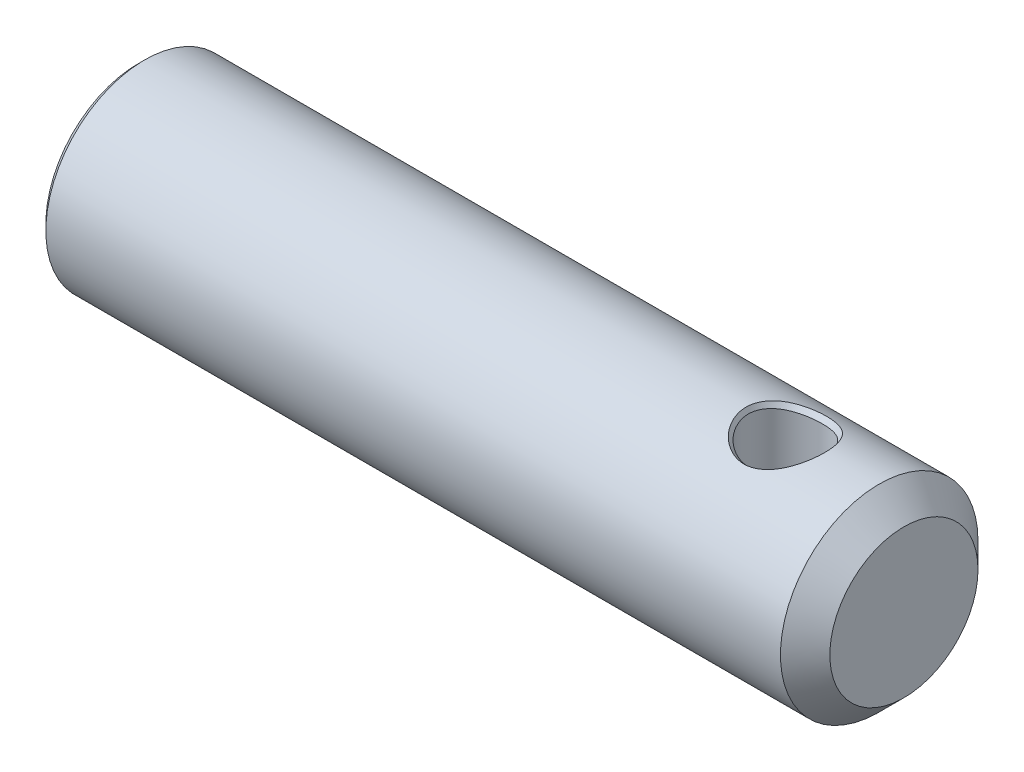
ISO-10303-21;
HEADER;
FILE_DESCRIPTION(('STEP AP214'),'2;1');
FILE_NAME('part.step','',(''),(''),'','','');
FILE_SCHEMA(('AUTOMOTIVE_DESIGN { 1 0 10303 214 1 1 1 1 }'));
ENDSEC;
DATA;
#1=APPLICATION_CONTEXT('core data for automotive mechanical design processes');
#2=APPLICATION_PROTOCOL_DEFINITION('international standard','automotive_design',2000,#1);
#3=PRODUCT_CONTEXT('',#1,'mechanical');
#4=PRODUCT('Part','Part','',(#3));
#5=PRODUCT_RELATED_PRODUCT_CATEGORY('part','',(#4));
#6=PRODUCT_DEFINITION_FORMATION('','',#4);
#7=PRODUCT_DEFINITION_CONTEXT('part definition',#1,'design');
#8=PRODUCT_DEFINITION('design','',#6,#7);
#9=PRODUCT_DEFINITION_SHAPE('','',#8);
#10=(LENGTH_UNIT() NAMED_UNIT(*) SI_UNIT(.MILLI.,.METRE.));
#11=(NAMED_UNIT(*) PLANE_ANGLE_UNIT() SI_UNIT($,.RADIAN.));
#12=(NAMED_UNIT(*) SI_UNIT($,.STERADIAN.) SOLID_ANGLE_UNIT());
#13=UNCERTAINTY_MEASURE_WITH_UNIT(LENGTH_MEASURE(1.E-05),#10,'distance_accuracy_value','');
#14=(GEOMETRIC_REPRESENTATION_CONTEXT(3) GLOBAL_UNCERTAINTY_ASSIGNED_CONTEXT((#13)) GLOBAL_UNIT_ASSIGNED_CONTEXT((#10,
#11,#12)) REPRESENTATION_CONTEXT('',''));
#15=CARTESIAN_POINT('',(0.,0.,0.));
#16=DIRECTION('',(0.,0.,1.));
#17=DIRECTION('',(1.,0.,0.));
#18=AXIS2_PLACEMENT_3D('',#15,#16,#17);
#19=CARTESIAN_POINT('',(31.,0.,0.));
#20=DIRECTION('',(-1.,0.,0.));
#21=DIRECTION('',(0.,0.,1.));
#22=AXIS2_PLACEMENT_3D('',#19,#20,#21);
#23=CYLINDRICAL_SURFACE('',#22,4.);
#24=CARTESIAN_POINT('',(26.2,-3.63262491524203,1.67452567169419));
#25=CARTESIAN_POINT('',(26.1735415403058,-3.63263646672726,1.67449462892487));
#26=CARTESIAN_POINT('',(26.1470862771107,-3.63300387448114,1.67374769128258));
#27=CARTESIAN_POINT('',(26.0943341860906,-3.6344093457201,1.67084974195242));
#28=CARTESIAN_POINT('',(26.0680371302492,-3.63544579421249,1.66870211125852));
#29=CARTESIAN_POINT('',(26.015653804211,-3.63814726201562,1.66303317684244));
#30=CARTESIAN_POINT('',(25.9895673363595,-3.63981159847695,1.65951336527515));
#31=CARTESIAN_POINT('',(25.9376556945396,-3.64372588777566,1.65113222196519));
#32=CARTESIAN_POINT('',(25.9118305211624,-3.64597584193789,1.64627088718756));
#33=CARTESIAN_POINT('',(25.8604922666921,-3.65101896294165,1.63523786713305));
#34=CARTESIAN_POINT('',(25.8349794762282,-3.65381260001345,1.62906504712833));
#35=CARTESIAN_POINT('',(25.7843166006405,-3.6599008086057,1.61544002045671));
#36=CARTESIAN_POINT('',(25.7591671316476,-3.66319614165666,1.60798586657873));
#37=CARTESIAN_POINT('',(25.7092815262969,-3.67024565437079,1.59182878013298));
#38=CARTESIAN_POINT('',(25.6845463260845,-3.6740007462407,1.58312335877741));
#39=CARTESIAN_POINT('',(25.6355398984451,-3.68192781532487,1.56449409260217));
#40=CARTESIAN_POINT('',(25.6112698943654,-3.68610074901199,1.55456743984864));
#41=CARTESIAN_POINT('',(25.5632445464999,-3.69482163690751,1.53352584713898));
#42=CARTESIAN_POINT('',(25.5394906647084,-3.69937051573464,1.52240795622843));
#43=CARTESIAN_POINT('',(25.492548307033,-3.70880150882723,1.49901385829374));
#44=CARTESIAN_POINT('',(25.4693614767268,-3.7136844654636,1.48673469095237));
#45=CARTESIAN_POINT('',(25.4236040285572,-3.7237418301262,1.46104787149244));
#46=CARTESIAN_POINT('',(25.4010351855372,-3.72891696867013,1.44763734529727));
#47=CARTESIAN_POINT('',(25.3565645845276,-3.73951709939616,1.4197175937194));
#48=CARTESIAN_POINT('',(25.3346646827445,-3.74494269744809,1.40520564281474));
#49=CARTESIAN_POINT('',(25.2915828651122,-3.75600155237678,1.37511260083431));
#50=CARTESIAN_POINT('',(25.2704028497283,-3.76163528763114,1.35952896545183));
#51=CARTESIAN_POINT('',(25.2288118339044,-3.77307049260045,1.32732271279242));
#52=CARTESIAN_POINT('',(25.2084027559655,-3.77887232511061,1.31069774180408));
#53=CARTESIAN_POINT('',(25.168404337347,-3.79059528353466,1.27643661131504));
#54=CARTESIAN_POINT('',(25.1488169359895,-3.7965166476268,1.25879826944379));
#55=CARTESIAN_POINT('',(25.1105138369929,-3.80846207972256,1.22254703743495));
#56=CARTESIAN_POINT('',(25.091800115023,-3.81448634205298,1.20393212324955));
#57=CARTESIAN_POINT('',(25.0552871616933,-3.82650315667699,1.16572661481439));
#58=CARTESIAN_POINT('',(25.0374902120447,-3.83249559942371,1.14613380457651));
#59=CARTESIAN_POINT('',(25.0028313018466,-3.84432236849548,1.10599942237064));
#60=CARTESIAN_POINT('',(24.9859718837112,-3.85015624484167,1.08545552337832));
#61=CARTESIAN_POINT('',(24.9532178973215,-3.86165718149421,1.04348271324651));
#62=CARTESIAN_POINT('',(24.9373258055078,-3.86732379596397,1.02205174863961));
#63=CARTESIAN_POINT('',(24.9065353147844,-3.87844939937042,0.978359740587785));
#64=CARTESIAN_POINT('',(24.8916392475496,-3.88390788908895,0.956096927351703));
#65=CARTESIAN_POINT('',(24.8628700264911,-3.89458503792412,0.910798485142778));
#66=CARTESIAN_POINT('',(24.8489990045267,-3.89980318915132,0.887761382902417));
#67=CARTESIAN_POINT('',(24.8223090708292,-3.90996510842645,0.840970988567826));
#68=CARTESIAN_POINT('',(24.8094920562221,-3.914908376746,0.817216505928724));
#69=CARTESIAN_POINT('',(24.7849393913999,-3.92448657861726,0.769048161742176));
#70=CARTESIAN_POINT('',(24.7732053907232,-3.929121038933,0.7446333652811));
#71=CARTESIAN_POINT('',(24.750848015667,-3.93804748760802,0.695201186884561));
#72=CARTESIAN_POINT('',(24.7402260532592,-3.94233903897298,0.670183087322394));
#73=CARTESIAN_POINT('',(24.7201220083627,-3.95054556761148,0.619601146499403));
#74=CARTESIAN_POINT('',(24.7106411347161,-3.95446014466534,0.594036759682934));
#75=CARTESIAN_POINT('',(24.6928484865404,-3.96187861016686,0.542419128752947));
#76=CARTESIAN_POINT('',(24.6845377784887,-3.96538212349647,0.516365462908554));
#77=CARTESIAN_POINT('',(24.6691146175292,-3.97194436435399,0.46382620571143));
#78=CARTESIAN_POINT('',(24.6620031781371,-3.97500271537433,0.437340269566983));
#79=CARTESIAN_POINT('',(24.6490076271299,-3.98064055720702,0.383993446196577));
#80=CARTESIAN_POINT('',(24.643124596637,-3.98321962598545,0.357132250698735));
#81=CARTESIAN_POINT('',(24.6326147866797,-3.98786489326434,0.303091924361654));
#82=CARTESIAN_POINT('',(24.6279893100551,-3.98993055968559,0.275912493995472));
#83=CARTESIAN_POINT('',(24.6200234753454,-3.99351501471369,0.221292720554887));
#84=CARTESIAN_POINT('',(24.6166848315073,-3.99503307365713,0.193852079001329));
#85=CARTESIAN_POINT('',(24.6113209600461,-3.99748864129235,0.138766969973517));
#86=CARTESIAN_POINT('',(24.6092980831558,-3.99842511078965,0.111122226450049));
#87=CARTESIAN_POINT('',(24.6065952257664,-3.99968303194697,0.0556857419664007));
#88=CARTESIAN_POINT('',(24.6059184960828,-4.00000299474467,0.027893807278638));
#89=CARTESIAN_POINT('',(24.6059318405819,-3.99999700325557,-0.0276839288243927));
#90=CARTESIAN_POINT('',(24.6066216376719,-3.99967117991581,-0.0554697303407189));
#91=CARTESIAN_POINT('',(24.6093431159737,-3.99840624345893,-0.110883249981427));
#92=CARTESIAN_POINT('',(24.6113710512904,-3.99746884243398,-0.138511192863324));
#93=CARTESIAN_POINT('',(24.6167399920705,-3.99501427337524,-0.193553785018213));
#94=CARTESIAN_POINT('',(24.6200782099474,-3.99349833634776,-0.220968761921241));
#95=CARTESIAN_POINT('',(24.6280377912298,-3.98992096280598,-0.275530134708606));
#96=CARTESIAN_POINT('',(24.6326570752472,-3.98786041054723,-0.302676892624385));
#97=CARTESIAN_POINT('',(24.6431494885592,-3.9832277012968,-0.356646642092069));
#98=CARTESIAN_POINT('',(24.6490210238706,-3.98065619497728,-0.383469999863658));
#99=CARTESIAN_POINT('',(24.6619887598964,-3.97503542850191,-0.436737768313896));
#100=CARTESIAN_POINT('',(24.6690836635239,-3.97198667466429,-0.463182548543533));
#101=CARTESIAN_POINT('',(24.6844691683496,-3.96544516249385,-0.51563797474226));
#102=CARTESIAN_POINT('',(24.6927586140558,-3.96195283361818,-0.541649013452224));
#103=CARTESIAN_POINT('',(24.7105043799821,-3.95455786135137,-0.593181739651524));
#104=CARTESIAN_POINT('',(24.719959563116,-3.95065561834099,-0.618703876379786));
#105=CARTESIAN_POINT('',(24.7400081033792,-3.94247446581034,-0.669203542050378));
#106=CARTESIAN_POINT('',(24.7506002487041,-3.93819595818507,-0.694181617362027));
#107=CARTESIAN_POINT('',(24.7728941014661,-3.92929588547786,-0.743537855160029));
#108=CARTESIAN_POINT('',(24.784594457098,-3.92467473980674,-0.767916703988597));
#109=CARTESIAN_POINT('',(24.8090761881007,-3.91512303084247,-0.816019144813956));
#110=CARTESIAN_POINT('',(24.8218560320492,-3.91019290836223,-0.839743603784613));
#111=CARTESIAN_POINT('',(24.8484682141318,-3.90005671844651,-0.886481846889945));
#112=CARTESIAN_POINT('',(24.8622988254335,-3.89485110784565,-0.909496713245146));
#113=CARTESIAN_POINT('',(24.8909841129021,-3.88419803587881,-0.954760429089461));
#114=CARTESIAN_POINT('',(24.9058368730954,-3.87875103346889,-0.977010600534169));
#115=CARTESIAN_POINT('',(24.9365377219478,-3.86764699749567,-1.02068913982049));
#116=CARTESIAN_POINT('',(24.9523837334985,-3.86199041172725,-1.04211908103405));
#117=CARTESIAN_POINT('',(24.9850434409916,-3.85050755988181,-1.08410292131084));
#118=CARTESIAN_POINT('',(25.0018549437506,-3.84468169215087,-1.10465863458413));
#119=CARTESIAN_POINT('',(25.0364137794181,-3.83286897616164,-1.14483398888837));
#120=CARTESIAN_POINT('',(25.0541588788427,-3.82688252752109,-1.16445566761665));
#121=CARTESIAN_POINT('',(25.0905739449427,-3.8148733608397,-1.20273027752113));
#122=CARTESIAN_POINT('',(25.1092419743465,-3.80885074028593,-1.2213850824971));
#123=CARTESIAN_POINT('',(25.1474685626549,-3.7969030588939,-1.2577185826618));
#124=CARTESIAN_POINT('',(25.1670254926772,-3.79097784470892,-1.27539894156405));
#125=CARTESIAN_POINT('',(25.2069747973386,-3.77924289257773,-1.30974777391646));
#126=CARTESIAN_POINT('',(25.227365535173,-3.77343295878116,-1.32641808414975));
#127=CARTESIAN_POINT('',(25.2689315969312,-3.76197797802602,-1.35871679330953));
#128=CARTESIAN_POINT('',(25.2901052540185,-3.75633262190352,-1.37434722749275));
#129=CARTESIAN_POINT('',(25.3331851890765,-3.74524780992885,-1.40453456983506));
#130=CARTESIAN_POINT('',(25.3550897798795,-3.73980793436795,-1.41909373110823));
#131=CARTESIAN_POINT('',(25.3995799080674,-3.72917735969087,-1.44710731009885));
#132=CARTESIAN_POINT('',(25.4221637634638,-3.72398611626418,-1.46056419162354));
#133=CARTESIAN_POINT('',(25.467960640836,-3.71389549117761,-1.48634188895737));
#134=CARTESIAN_POINT('',(25.4911720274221,-3.70899544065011,-1.49866534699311));
#135=CARTESIAN_POINT('',(25.5381721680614,-3.69953004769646,-1.52214493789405));
#136=CARTESIAN_POINT('',(25.5619593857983,-3.69496392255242,-1.53330382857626));
#137=CARTESIAN_POINT('',(25.6100593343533,-3.68620917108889,-1.55442308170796));
#138=CARTESIAN_POINT('',(25.6343706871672,-3.6820196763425,-1.56438622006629));
#139=CARTESIAN_POINT('',(25.6834669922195,-3.67406095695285,-1.58308286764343));
#140=CARTESIAN_POINT('',(25.7082507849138,-3.6702908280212,-1.59181903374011));
#141=CARTESIAN_POINT('',(25.7582400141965,-3.66321355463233,-1.60803077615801));
#142=CARTESIAN_POINT('',(25.7834445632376,-3.65990554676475,-1.61550870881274));
#143=CARTESIAN_POINT('',(25.8342232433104,-3.65379514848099,-1.62917320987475));
#144=CARTESIAN_POINT('',(25.8597967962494,-3.65099204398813,-1.63536160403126));
#145=CARTESIAN_POINT('',(25.9112616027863,-3.64593397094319,-1.64641649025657));
#146=CARTESIAN_POINT('',(25.9371525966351,-3.64367858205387,-1.65128399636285));
#147=CARTESIAN_POINT('',(25.9891996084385,-3.63975830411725,-1.65966685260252));
#148=CARTESIAN_POINT('',(26.0153556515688,-3.63809347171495,-1.66318207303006));
#149=CARTESIAN_POINT('',(26.0678830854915,-3.63539648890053,-1.66883045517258));
#150=CARTESIAN_POINT('',(26.0942546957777,-3.63436509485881,-1.670961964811));
#151=CARTESIAN_POINT('',(26.133902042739,-3.63332463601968,-1.67309910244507));
#152=CARTESIAN_POINT('',(26.1471448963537,-3.63306224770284,-1.673634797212));
#153=CARTESIAN_POINT('',(26.1736647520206,-3.63271151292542,-1.67434934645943));
#154=CARTESIAN_POINT('',(26.186941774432,-3.63262345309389,-1.67452761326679));
#155=CARTESIAN_POINT('',(26.2134954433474,-3.63262639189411,-1.67452369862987));
#156=CARTESIAN_POINT('',(26.2267720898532,-3.6327173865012,-1.67434152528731));
#157=CARTESIAN_POINT('',(26.2532904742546,-3.63307343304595,-1.67361962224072));
#158=CARTESIAN_POINT('',(26.2665322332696,-3.63333819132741,-1.67308049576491));
#159=CARTESIAN_POINT('',(26.3061743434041,-3.63438513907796,-1.6709336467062));
#160=CARTESIAN_POINT('',(26.3325416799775,-3.63542004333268,-1.66879642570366));
#161=CARTESIAN_POINT('',(26.3850579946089,-3.63812254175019,-1.66313810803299));
#162=CARTESIAN_POINT('',(26.4112072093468,-3.63978932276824,-1.65961878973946));
#163=CARTESIAN_POINT('',(26.4632381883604,-3.6437121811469,-1.65122925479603));
#164=CARTESIAN_POINT('',(26.4891200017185,-3.64596814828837,-1.64635929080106));
#165=CARTESIAN_POINT('',(26.5405642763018,-3.65102620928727,-1.6353010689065));
#166=CARTESIAN_POINT('',(26.5661265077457,-3.65382867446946,-1.62911191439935));
#167=CARTESIAN_POINT('',(26.6168805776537,-3.65993678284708,-1.61544752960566));
#168=CARTESIAN_POINT('',(26.6420718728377,-3.66324309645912,-1.60797058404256));
#169=CARTESIAN_POINT('',(26.6920328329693,-3.67031612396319,-1.59176251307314));
#170=CARTESIAN_POINT('',(26.7168016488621,-3.6740836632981,-1.5830291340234));
#171=CARTESIAN_POINT('',(26.7658664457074,-3.68203650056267,-1.56433981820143));
#172=CARTESIAN_POINT('',(26.790161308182,-3.68622267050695,-1.55438131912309));
#173=CARTESIAN_POINT('',(26.8382269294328,-3.69497022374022,-1.53327316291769));
#174=CARTESIAN_POINT('',(26.8619963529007,-3.69953244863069,-1.52212081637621));
#175=CARTESIAN_POINT('',(26.9089597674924,-3.70898964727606,-1.49865619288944));
#176=CARTESIAN_POINT('',(26.9321522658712,-3.71388538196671,-1.48634123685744));
#177=CARTESIAN_POINT('',(26.9779104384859,-3.72396713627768,-1.46058248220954));
#178=CARTESIAN_POINT('',(27.0004745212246,-3.72915380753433,-1.44713611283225));
#179=CARTESIAN_POINT('',(27.0449243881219,-3.73977515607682,-1.41914555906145));
#180=CARTESIAN_POINT('',(27.0668085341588,-3.74521036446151,-1.40459897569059));
#181=CARTESIAN_POINT('',(27.1098470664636,-3.75628591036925,-1.37443883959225));
#182=CARTESIAN_POINT('',(27.1309998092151,-3.7619266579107,-1.35882309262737));
#183=CARTESIAN_POINT('',(27.1725237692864,-3.77337266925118,-1.32655590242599));
#184=CARTESIAN_POINT('',(27.1928933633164,-3.77917823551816,-1.30990247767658));
#185=CARTESIAN_POINT('',(27.2328002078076,-3.79090477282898,-1.27558948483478));
#186=CARTESIAN_POINT('',(27.2523358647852,-3.79682593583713,-1.25792812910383));
#187=CARTESIAN_POINT('',(27.2905203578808,-3.80876630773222,-1.2216352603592));
#188=CARTESIAN_POINT('',(27.3091676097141,-3.81478566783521,-1.20300212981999));
#189=CARTESIAN_POINT('',(27.3455477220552,-3.82679056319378,-1.16476381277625));
#190=CARTESIAN_POINT('',(27.3632782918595,-3.83277598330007,-1.14515641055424));
#191=CARTESIAN_POINT('',(27.3978200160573,-3.84458990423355,-1.10499479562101));
#192=CARTESIAN_POINT('',(27.4146282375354,-3.85041787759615,-1.0844379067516));
#193=CARTESIAN_POINT('',(27.4472917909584,-3.86190789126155,-1.04243907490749));
#194=CARTESIAN_POINT('',(27.4631443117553,-3.8675694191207,-1.0209948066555));
#195=CARTESIAN_POINT('',(27.493866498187,-3.87868555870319,-0.977276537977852));
#196=CARTESIAN_POINT('',(27.5087335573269,-3.88413960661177,-0.955000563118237));
#197=CARTESIAN_POINT('',(27.5374538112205,-3.8948083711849,-0.909675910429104));
#198=CARTESIAN_POINT('',(27.5513046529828,-3.90002252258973,-0.886625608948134));
#199=CARTESIAN_POINT('',(27.5779616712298,-3.91017673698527,-0.839808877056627));
#200=CARTESIAN_POINT('',(27.5907657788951,-3.91511625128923,-0.816041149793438));
#201=CARTESIAN_POINT('',(27.6152984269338,-3.92468703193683,-0.767846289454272));
#202=CARTESIAN_POINT('',(27.6270251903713,-3.92931778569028,-0.743418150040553));
#203=CARTESIAN_POINT('',(27.6493722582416,-3.93823669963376,-0.693959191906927));
#204=CARTESIAN_POINT('',(27.6599910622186,-3.94252439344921,-0.668927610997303));
#205=CARTESIAN_POINT('',(27.6800913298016,-3.95072287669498,-0.618318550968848));
#206=CARTESIAN_POINT('',(27.6895715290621,-3.95463324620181,-0.592740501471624));
#207=CARTESIAN_POINT('',(27.7073637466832,-3.96204275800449,-0.541095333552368));
#208=CARTESIAN_POINT('',(27.7156746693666,-3.96554151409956,-0.515027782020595));
#209=CARTESIAN_POINT('',(27.7310975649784,-3.97209349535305,-0.462460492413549));
#210=CARTESIAN_POINT('',(27.7382085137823,-3.97514633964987,-0.435960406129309));
#211=CARTESIAN_POINT('',(27.7512007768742,-3.98077221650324,-0.382584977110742));
#212=CARTESIAN_POINT('',(27.7570810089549,-3.98334482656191,-0.35570932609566));
#213=CARTESIAN_POINT('',(27.7675813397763,-3.9879760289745,-0.301639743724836));
#214=CARTESIAN_POINT('',(27.7722001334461,-3.9900340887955,-0.274445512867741));
#215=CARTESIAN_POINT('',(27.7801470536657,-3.99360196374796,-0.219795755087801));
#216=CARTESIAN_POINT('',(27.7834734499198,-3.99511104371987,-0.192339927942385));
#217=CARTESIAN_POINT('',(27.7888060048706,-3.9975471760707,-0.137224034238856));
#218=CARTESIAN_POINT('',(27.7908097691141,-3.99847317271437,-0.109563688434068));
#219=CARTESIAN_POINT('',(27.7934648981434,-3.99970817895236,-0.0540955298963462));
#220=CARTESIAN_POINT('',(27.7941129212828,-4.00001566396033,-0.0262875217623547));
#221=CARTESIAN_POINT('',(27.794035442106,-3.99998376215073,0.0293205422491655));
#222=CARTESIAN_POINT('',(27.7933102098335,-3.99964450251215,0.0571205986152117));
#223=CARTESIAN_POINT('',(27.7905161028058,-3.99835298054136,0.112558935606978));
#224=CARTESIAN_POINT('',(27.7884510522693,-3.99740246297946,0.140197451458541));
#225=CARTESIAN_POINT('',(27.7830058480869,-3.99492178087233,0.195257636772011));
#226=CARTESIAN_POINT('',(27.7796285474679,-3.99339287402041,0.222679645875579));
#227=CARTESIAN_POINT('',(27.7715899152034,-3.98978989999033,0.277251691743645));
#228=CARTESIAN_POINT('',(27.7669307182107,-3.98771673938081,0.304402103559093));
#229=CARTESIAN_POINT('',(27.7563583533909,-3.98305926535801,0.358375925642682));
#230=CARTESIAN_POINT('',(27.7504468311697,-3.98047562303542,0.385199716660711));
#231=CARTESIAN_POINT('',(27.7373998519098,-3.97483117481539,0.438465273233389));
#232=CARTESIAN_POINT('',(27.7302657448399,-3.97177089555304,0.464907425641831));
#233=CARTESIAN_POINT('',(27.7148033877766,-3.96520705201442,0.517354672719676));
#234=CARTESIAN_POINT('',(27.7064763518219,-3.96170393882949,0.543360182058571));
#235=CARTESIAN_POINT('',(27.6886577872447,-3.95428824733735,0.594879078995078));
#236=CARTESIAN_POINT('',(27.6791674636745,-3.950376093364,0.620392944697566));
#237=CARTESIAN_POINT('',(27.6590518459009,-3.94217609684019,0.670873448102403));
#238=CARTESIAN_POINT('',(27.6484278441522,-3.93788868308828,0.695840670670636));
#239=CARTESIAN_POINT('',(27.6260743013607,-3.92897190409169,0.745172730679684));
#240=CARTESIAN_POINT('',(27.6143462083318,-3.92434298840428,0.769538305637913));
#241=CARTESIAN_POINT('',(27.5898138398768,-3.91477697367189,0.817611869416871));
#242=CARTESIAN_POINT('',(27.5770112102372,-3.90984034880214,0.841320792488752));
#243=CARTESIAN_POINT('',(27.5503591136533,-3.89969251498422,0.888025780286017));
#244=CARTESIAN_POINT('',(27.536511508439,-3.89448179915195,0.911023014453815));
#245=CARTESIAN_POINT('',(27.5077986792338,-3.88382001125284,0.956249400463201));
#246=CARTESIAN_POINT('',(27.4929355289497,-3.87836943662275,0.978479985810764));
#247=CARTESIAN_POINT('',(27.4622212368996,-3.86725986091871,1.02211748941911));
#248=CARTESIAN_POINT('',(27.4463723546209,-3.86160134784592,1.04352612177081));
#249=CARTESIAN_POINT('',(27.413714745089,-3.85011644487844,1.08546534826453));
#250=CARTESIAN_POINT('',(27.3969084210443,-3.84429049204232,1.10599793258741));
#251=CARTESIAN_POINT('',(27.3623697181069,-3.83247929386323,1.14612612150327));
#252=CARTESIAN_POINT('',(27.3446398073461,-3.82649449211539,1.16572397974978));
#253=CARTESIAN_POINT('',(27.3082580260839,-3.81449017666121,1.20395019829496));
#254=CARTESIAN_POINT('',(27.2896081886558,-3.80847076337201,1.22258052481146));
#255=CARTESIAN_POINT('',(27.2514146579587,-3.79653075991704,1.25886441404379));
#256=CARTESIAN_POINT('',(27.2318725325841,-3.79061001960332,1.27651957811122));
#257=CARTESIAN_POINT('',(27.1919514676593,-3.77888493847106,1.31081831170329));
#258=CARTESIAN_POINT('',(27.1715741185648,-3.77308040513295,1.32746366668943));
#259=CARTESIAN_POINT('',(27.1300340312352,-3.76163711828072,1.35971243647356));
#260=CARTESIAN_POINT('',(27.1088729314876,-3.75599805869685,1.37531785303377));
#261=CARTESIAN_POINT('',(27.0658182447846,-3.74492662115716,1.40545514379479));
#262=CARTESIAN_POINT('',(27.0439263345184,-3.73949382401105,1.41998925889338));
#263=CARTESIAN_POINT('',(26.999462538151,-3.72887810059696,1.44795264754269));
#264=CARTESIAN_POINT('',(26.9768923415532,-3.72369462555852,1.46138439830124));
#265=CARTESIAN_POINT('',(26.9311246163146,-3.71362014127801,1.4871116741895));
#266=CARTESIAN_POINT('',(26.9079287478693,-3.70872845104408,1.49940988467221));
#267=CARTESIAN_POINT('',(26.8609623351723,-3.69928029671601,1.52283874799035));
#268=CARTESIAN_POINT('',(26.8371933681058,-3.69472302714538,1.53397223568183));
#269=CARTESIAN_POINT('',(26.7891334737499,-3.68598642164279,1.55504037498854));
#270=CARTESIAN_POINT('',(26.7648439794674,-3.68180618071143,1.56497791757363));
#271=CARTESIAN_POINT('',(26.7157958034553,-3.67386632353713,1.58362298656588));
#272=CARTESIAN_POINT('',(26.6910383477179,-3.67010574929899,1.59233332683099));
#273=CARTESIAN_POINT('',(26.6411070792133,-3.6630478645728,1.60849294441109));
#274=CARTESIAN_POINT('',(26.6159342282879,-3.65974961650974,1.61594478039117));
#275=CARTESIAN_POINT('',(26.5652250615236,-3.65365893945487,1.62955653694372));
#276=CARTESIAN_POINT('',(26.5396894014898,-3.65086569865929,1.635718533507));
#277=CARTESIAN_POINT('',(26.4883075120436,-3.6458275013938,1.64671994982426));
#278=CARTESIAN_POINT('',(26.4624616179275,-3.64358200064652,1.6515606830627));
#279=CARTESIAN_POINT('',(26.4105122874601,-3.6396815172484,1.6598893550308));
#280=CARTESIAN_POINT('',(26.3844088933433,-3.63802643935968,1.66337751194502));
#281=CARTESIAN_POINT('',(26.3319970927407,-3.63534915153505,1.66897056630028));
#282=CARTESIAN_POINT('',(26.3056885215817,-3.63432751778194,1.67107420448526));
#283=CARTESIAN_POINT('',(26.2529205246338,-3.63295809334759,1.67387033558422));
#284=CARTESIAN_POINT('',(26.2264608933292,-3.63261180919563,1.67455967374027));
#285=CARTESIAN_POINT('',(26.2,-3.63262491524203,1.67452567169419));
#286=B_SPLINE_CURVE_WITH_KNOTS('',3,(#24,#25,#26,#27,#28,#29,#30,#31,#32,#33,#34,#35,#36,#37,
#38,#39,#40,#41,#42,#43,#44,#45,#46,#47,#48,#49,#50,#51,#52,#53,#54,#55,#56,#57,#58,#59,#60,#61,
#62,#63,#64,#65,#66,#67,#68,#69,#70,#71,#72,#73,#74,#75,#76,#77,#78,#79,#80,#81,#82,#83,#84,#85,
#86,#87,#88,#89,#90,#91,#92,#93,#94,#95,#96,#97,#98,#99,#100,#101,#102,#103,#104,#105,#106,#107,
#108,#109,#110,#111,#112,#113,#114,#115,#116,#117,#118,#119,#120,#121,#122,#123,#124,#125,#126,
#127,#128,#129,#130,#131,#132,#133,#134,#135,#136,#137,#138,#139,#140,#141,#142,#143,#144,#145,
#146,#147,#148,#149,#150,#151,#152,#153,#154,#155,#156,#157,#158,#159,#160,#161,#162,#163,#164,
#165,#166,#167,#168,#169,#170,#171,#172,#173,#174,#175,#176,#177,#178,#179,#180,#181,#182,#183,
#184,#185,#186,#187,#188,#189,#190,#191,#192,#193,#194,#195,#196,#197,#198,#199,#200,#201,#202,
#203,#204,#205,#206,#207,#208,#209,#210,#211,#212,#213,#214,#215,#216,#217,#218,#219,#220,#221,
#222,#223,#224,#225,#226,#227,#228,#229,#230,#231,#232,#233,#234,#235,#236,#237,#238,#239,#240,
#241,#242,#243,#244,#245,#246,#247,#248,#249,#250,#251,#252,#253,#254,#255,#256,#257,#258,#259,
#260,#261,#262,#263,#264,#265,#266,#267,#268,#269,#270,#271,#272,#273,#274,#275,#276,#277,#278,
#279,#280,#281,#282,#283,#284,#285),.UNSPECIFIED.,.F.,.F.,(4,2,2,2,2,2,2,2,2,2,2,2,2,2,2,2,2,2,
2,2,2,2,2,2,2,2,2,2,2,2,2,2,2,2,2,2,2,2,2,2,2,2,2,2,2,2,2,2,2,2,2,2,2,2,2,2,2,2,2,2,2,2,2,2,2,2,
2,2,2,2,2,2,2,2,2,2,2,2,2,2,2,2,2,2,2,2,2,2,2,2,2,2,2,2,2,2,2,2,2,2,2,2,2,2,2,2,2,2,2,2,2,2,2,2,
2,2,2,2,2,2,2,2,2,2,2,2,2,2,2,2,4),(0.,0.0793602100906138,0.158529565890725,0.237613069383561,
0.31669675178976,0.39584913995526,0.475122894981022,0.554556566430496,0.634176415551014,
0.713998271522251,0.794029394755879,0.874270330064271,0.95471673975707,1.03536121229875,
1.11619504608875,1.19721001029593,1.27840008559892,1.35978333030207,1.44137746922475,
1.52317239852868,1.60515254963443,1.68729866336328,1.76958953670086,1.8520037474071,
1.93452136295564,2.01712564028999,2.09980472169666,2.18255332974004,2.26537446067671,
2.34828107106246,2.43129774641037,2.51446233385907,2.5978275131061,2.68117578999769,
2.7642917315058,2.84723179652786,2.93003801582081,3.0127394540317,3.09535374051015,
3.17788864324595,3.26034366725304,3.34271166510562,3.42498045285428,3.50713442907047,
3.58915619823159,3.67102820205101,3.75273436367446,3.83426174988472,3.9156022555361,
3.99677872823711,4.07781201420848,4.15869322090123,4.23941116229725,4.31995417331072,
4.40031194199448,4.48047736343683,4.56044841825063,4.64023007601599,4.7198362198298,
4.7992915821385,4.87863367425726,4.95791468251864,5.03720329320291,5.11658639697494,
5.15635032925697,5.19617958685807,5.23600794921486,5.27576917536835,5.35514141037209,
5.4344118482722,5.51366746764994,5.59297712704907,5.67239325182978,5.7519536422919,
5.83168335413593,5.91159661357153,5.99169874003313,6.07198805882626,6.15245779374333,
6.23309793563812,6.3138970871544,6.39484428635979,6.47593081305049,6.55721103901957,
6.63873630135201,6.72049071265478,6.80245337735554,6.88460019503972,6.96690563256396,
7.04934447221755,7.1318935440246,7.2145334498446,7.29725028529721,7.38003736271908,
7.46289693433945,7.54584190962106,7.62889755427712,7.71210315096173,7.79551359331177,
7.87890763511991,7.96206468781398,8.04504194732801,8.12788185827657,8.2106135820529,
8.29325453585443,8.37581197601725,8.45828460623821,8.54066419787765,8.62293721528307,
8.70508644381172,8.78709262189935,8.86893608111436,8.95059839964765,9.03206407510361,
9.1133222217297,9.19440819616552,9.27535679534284,9.35615782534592,9.43679854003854,
9.51726548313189,9.59754634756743,9.67763185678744,9.75751767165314,9.8372063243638,
9.91670917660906,9.99604839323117,10.0752589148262,10.1543904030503,10.233509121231,
10.3126997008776,10.3920667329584),.UNSPECIFIED.);
#287=CARTESIAN_POINT('',(26.2,-3.63262491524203,1.67452567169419));
#288=VERTEX_POINT('',#287);
#289=EDGE_CURVE('E54',#288,#288,#286,.F.);
#290=ORIENTED_EDGE('',*,*,#289,.T.);
#291=EDGE_LOOP('',(#290));
#292=FACE_BOUND('',#291,.T.);
#293=CARTESIAN_POINT('',(26.2,3.63262491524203,1.67452567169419));
#294=CARTESIAN_POINT('',(26.2264584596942,3.63263646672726,1.67449462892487));
#295=CARTESIAN_POINT('',(26.2529137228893,3.63300387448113,1.67374769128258));
#296=CARTESIAN_POINT('',(26.3056658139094,3.6344093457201,1.67084974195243));
#297=CARTESIAN_POINT('',(26.3319628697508,3.63544579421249,1.66870211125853));
#298=CARTESIAN_POINT('',(26.384346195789,3.63814726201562,1.66303317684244));
#299=CARTESIAN_POINT('',(26.4104326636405,3.63981159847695,1.65951336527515));
#300=CARTESIAN_POINT('',(26.4623443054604,3.64372588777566,1.65113222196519));
#301=CARTESIAN_POINT('',(26.4881694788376,3.64597584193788,1.64627088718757));
#302=CARTESIAN_POINT('',(26.5395077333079,3.65101896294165,1.63523786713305));
#303=CARTESIAN_POINT('',(26.5650205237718,3.65381260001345,1.62906504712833));
#304=CARTESIAN_POINT('',(26.6156833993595,3.6599008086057,1.61544002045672));
#305=CARTESIAN_POINT('',(26.6408328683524,3.66319614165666,1.60798586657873));
#306=CARTESIAN_POINT('',(26.6907184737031,3.67024565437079,1.59182878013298));
#307=CARTESIAN_POINT('',(26.7154536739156,3.67400074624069,1.58312335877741));
#308=CARTESIAN_POINT('',(26.7644601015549,3.68192781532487,1.56449409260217));
#309=CARTESIAN_POINT('',(26.7887301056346,3.68610074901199,1.55456743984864));
#310=CARTESIAN_POINT('',(26.8367554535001,3.69482163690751,1.53352584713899));
#311=CARTESIAN_POINT('',(26.8605093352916,3.69937051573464,1.52240795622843));
#312=CARTESIAN_POINT('',(26.907451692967,3.70880150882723,1.49901385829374));
#313=CARTESIAN_POINT('',(26.9306385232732,3.7136844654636,1.48673469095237));
#314=CARTESIAN_POINT('',(26.9763959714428,3.7237418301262,1.46104787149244));
#315=CARTESIAN_POINT('',(26.9989648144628,3.72891696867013,1.44763734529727));
#316=CARTESIAN_POINT('',(27.0434354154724,3.73951709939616,1.4197175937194));
#317=CARTESIAN_POINT('',(27.0653353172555,3.74494269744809,1.40520564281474));
#318=CARTESIAN_POINT('',(27.1084171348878,3.75600155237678,1.37511260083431));
#319=CARTESIAN_POINT('',(27.1295971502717,3.76163528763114,1.35952896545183));
#320=CARTESIAN_POINT('',(27.1711881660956,3.77307049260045,1.32732271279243));
#321=CARTESIAN_POINT('',(27.1915972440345,3.77887232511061,1.31069774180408));
#322=CARTESIAN_POINT('',(27.231595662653,3.79059528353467,1.27643661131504));
#323=CARTESIAN_POINT('',(27.2511830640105,3.7965166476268,1.25879826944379));
#324=CARTESIAN_POINT('',(27.2894861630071,3.80846207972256,1.22254703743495));
#325=CARTESIAN_POINT('',(27.308199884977,3.81448634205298,1.20393212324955));
#326=CARTESIAN_POINT('',(27.3447128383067,3.82650315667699,1.16572661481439));
#327=CARTESIAN_POINT('',(27.3625097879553,3.83249559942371,1.14613380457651));
#328=CARTESIAN_POINT('',(27.3971686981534,3.84432236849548,1.10599942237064));
#329=CARTESIAN_POINT('',(27.4140281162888,3.85015624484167,1.08545552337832));
#330=CARTESIAN_POINT('',(27.4467821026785,3.86165718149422,1.04348271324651));
#331=CARTESIAN_POINT('',(27.4626741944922,3.86732379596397,1.02205174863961));
#332=CARTESIAN_POINT('',(27.4934646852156,3.87844939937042,0.978359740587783));
#333=CARTESIAN_POINT('',(27.5083607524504,3.88390788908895,0.956096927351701));
#334=CARTESIAN_POINT('',(27.5371299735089,3.89458503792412,0.910798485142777));
#335=CARTESIAN_POINT('',(27.5510009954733,3.89980318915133,0.887761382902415));
#336=CARTESIAN_POINT('',(27.5776909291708,3.90996510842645,0.840970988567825));
#337=CARTESIAN_POINT('',(27.5905079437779,3.91490837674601,0.817216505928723));
#338=CARTESIAN_POINT('',(27.6150606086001,3.92448657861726,0.769048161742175));
#339=CARTESIAN_POINT('',(27.6267946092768,3.929121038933,0.744633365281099));
#340=CARTESIAN_POINT('',(27.649151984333,3.93804748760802,0.695201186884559));
#341=CARTESIAN_POINT('',(27.6597739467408,3.94233903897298,0.670183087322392));
#342=CARTESIAN_POINT('',(27.6798779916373,3.95054556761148,0.619601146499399));
#343=CARTESIAN_POINT('',(27.6893588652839,3.95446014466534,0.594036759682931));
#344=CARTESIAN_POINT('',(27.7071515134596,3.96187861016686,0.542419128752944));
#345=CARTESIAN_POINT('',(27.7154622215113,3.96538212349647,0.516365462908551));
#346=CARTESIAN_POINT('',(27.7308853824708,3.97194436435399,0.463826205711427));
#347=CARTESIAN_POINT('',(27.7379968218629,3.97500271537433,0.43734026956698));
#348=CARTESIAN_POINT('',(27.7509923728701,3.98064055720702,0.383993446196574));
#349=CARTESIAN_POINT('',(27.756875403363,3.98321962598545,0.357132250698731));
#350=CARTESIAN_POINT('',(27.7673852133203,3.98786489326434,0.30309192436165));
#351=CARTESIAN_POINT('',(27.7720106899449,3.98993055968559,0.275912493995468));
#352=CARTESIAN_POINT('',(27.7799765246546,3.99351501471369,0.221292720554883));
#353=CARTESIAN_POINT('',(27.7833151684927,3.99503307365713,0.193852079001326));
#354=CARTESIAN_POINT('',(27.7886790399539,3.99748864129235,0.138766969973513));
#355=CARTESIAN_POINT('',(27.7907019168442,3.99842511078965,0.111122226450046));
#356=CARTESIAN_POINT('',(27.7934047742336,3.99968303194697,0.0556857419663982));
#357=CARTESIAN_POINT('',(27.7940815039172,4.00000299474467,0.027893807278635));
#358=CARTESIAN_POINT('',(27.7940681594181,3.99999700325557,-0.0276839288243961));
#359=CARTESIAN_POINT('',(27.7933783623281,3.99967117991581,-0.0554697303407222));
#360=CARTESIAN_POINT('',(27.7906568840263,3.99840624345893,-0.11088324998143));
#361=CARTESIAN_POINT('',(27.7886289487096,3.99746884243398,-0.138511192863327));
#362=CARTESIAN_POINT('',(27.7832600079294,3.99501427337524,-0.193553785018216));
#363=CARTESIAN_POINT('',(27.7799217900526,3.99349833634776,-0.220968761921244));
#364=CARTESIAN_POINT('',(27.7719622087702,3.98992096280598,-0.275530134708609));
#365=CARTESIAN_POINT('',(27.7673429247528,3.98786041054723,-0.302676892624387));
#366=CARTESIAN_POINT('',(27.7568505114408,3.9832277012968,-0.356646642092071));
#367=CARTESIAN_POINT('',(27.7509789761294,3.98065619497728,-0.38346999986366));
#368=CARTESIAN_POINT('',(27.7380112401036,3.97503542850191,-0.436737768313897));
#369=CARTESIAN_POINT('',(27.7309163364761,3.97198667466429,-0.463182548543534));
#370=CARTESIAN_POINT('',(27.7155308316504,3.96544516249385,-0.515637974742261));
#371=CARTESIAN_POINT('',(27.7072413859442,3.96195283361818,-0.541649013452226));
#372=CARTESIAN_POINT('',(27.6894956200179,3.95455786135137,-0.593181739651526));
#373=CARTESIAN_POINT('',(27.680040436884,3.95065561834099,-0.618703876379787));
#374=CARTESIAN_POINT('',(27.6599918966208,3.94247446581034,-0.669203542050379));
#375=CARTESIAN_POINT('',(27.6493997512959,3.93819595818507,-0.694181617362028));
#376=CARTESIAN_POINT('',(27.6271058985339,3.92929588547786,-0.743537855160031));
#377=CARTESIAN_POINT('',(27.615405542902,3.92467473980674,-0.767916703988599));
#378=CARTESIAN_POINT('',(27.5909238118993,3.91512303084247,-0.816019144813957));
#379=CARTESIAN_POINT('',(27.5781439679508,3.91019290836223,-0.839743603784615));
#380=CARTESIAN_POINT('',(27.5515317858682,3.90005671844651,-0.886481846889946));
#381=CARTESIAN_POINT('',(27.5377011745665,3.89485110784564,-0.909496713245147));
#382=CARTESIAN_POINT('',(27.5090158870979,3.88419803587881,-0.954760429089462));
#383=CARTESIAN_POINT('',(27.4941631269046,3.87875103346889,-0.977010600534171));
#384=CARTESIAN_POINT('',(27.4634622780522,3.86764699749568,-1.0206891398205));
#385=CARTESIAN_POINT('',(27.4476162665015,3.86199041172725,-1.04211908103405));
#386=CARTESIAN_POINT('',(27.4149565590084,3.85050755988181,-1.08410292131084));
#387=CARTESIAN_POINT('',(27.3981450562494,3.84468169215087,-1.10465863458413));
#388=CARTESIAN_POINT('',(27.3635862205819,3.83286897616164,-1.14483398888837));
#389=CARTESIAN_POINT('',(27.3458411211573,3.82688252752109,-1.16445566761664));
#390=CARTESIAN_POINT('',(27.3094260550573,3.81487336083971,-1.20273027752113));
#391=CARTESIAN_POINT('',(27.2907580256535,3.80885074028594,-1.22138508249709));
#392=CARTESIAN_POINT('',(27.2525314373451,3.7969030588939,-1.2577185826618));
#393=CARTESIAN_POINT('',(27.2329745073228,3.79097784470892,-1.27539894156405));
#394=CARTESIAN_POINT('',(27.1930252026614,3.77924289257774,-1.30974777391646));
#395=CARTESIAN_POINT('',(27.172634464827,3.77343295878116,-1.32641808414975));
#396=CARTESIAN_POINT('',(27.1310684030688,3.76197797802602,-1.35871679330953));
#397=CARTESIAN_POINT('',(27.1098947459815,3.75633262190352,-1.37434722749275));
#398=CARTESIAN_POINT('',(27.0668148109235,3.74524780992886,-1.40453456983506));
#399=CARTESIAN_POINT('',(27.0449102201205,3.73980793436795,-1.41909373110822));
#400=CARTESIAN_POINT('',(27.0004200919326,3.72917735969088,-1.44710731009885));
#401=CARTESIAN_POINT('',(26.9778362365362,3.72398611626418,-1.46056419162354));
#402=CARTESIAN_POINT('',(26.932039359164,3.71389549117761,-1.48634188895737));
#403=CARTESIAN_POINT('',(26.908827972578,3.70899544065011,-1.49866534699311));
#404=CARTESIAN_POINT('',(26.8618278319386,3.69953004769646,-1.52214493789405));
#405=CARTESIAN_POINT('',(26.8380406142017,3.69496392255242,-1.53330382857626));
#406=CARTESIAN_POINT('',(26.7899406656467,3.68620917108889,-1.55442308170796));
#407=CARTESIAN_POINT('',(26.7656293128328,3.6820196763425,-1.56438622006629));
#408=CARTESIAN_POINT('',(26.7165330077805,3.67406095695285,-1.58308286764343));
#409=CARTESIAN_POINT('',(26.6917492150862,3.6702908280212,-1.59181903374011));
#410=CARTESIAN_POINT('',(26.6417599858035,3.66321355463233,-1.60803077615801));
#411=CARTESIAN_POINT('',(26.6165554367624,3.65990554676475,-1.61550870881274));
#412=CARTESIAN_POINT('',(26.5657767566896,3.65379514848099,-1.62917320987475));
#413=CARTESIAN_POINT('',(26.5402032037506,3.65099204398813,-1.63536160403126));
#414=CARTESIAN_POINT('',(26.4887383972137,3.64593397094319,-1.64641649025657));
#415=CARTESIAN_POINT('',(26.462847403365,3.64367858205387,-1.65128399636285));
#416=CARTESIAN_POINT('',(26.4108003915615,3.63975830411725,-1.65966685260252));
#417=CARTESIAN_POINT('',(26.3846443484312,3.63809347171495,-1.66318207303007));
#418=CARTESIAN_POINT('',(26.3321169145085,3.63539648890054,-1.66883045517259));
#419=CARTESIAN_POINT('',(26.3057453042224,3.6343650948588,-1.670961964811));
#420=CARTESIAN_POINT('',(26.2660979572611,3.63332463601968,-1.67309910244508));
#421=CARTESIAN_POINT('',(26.2528551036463,3.63306224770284,-1.673634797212));
#422=CARTESIAN_POINT('',(26.2263352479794,3.63271151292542,-1.67434934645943));
#423=CARTESIAN_POINT('',(26.213058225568,3.63262345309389,-1.67452761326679));
#424=CARTESIAN_POINT('',(26.1865045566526,3.63262639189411,-1.67452369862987));
#425=CARTESIAN_POINT('',(26.1732279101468,3.6327173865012,-1.67434152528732));
#426=CARTESIAN_POINT('',(26.1467095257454,3.63307343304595,-1.67361962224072));
#427=CARTESIAN_POINT('',(26.1334677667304,3.63333819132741,-1.67308049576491));
#428=CARTESIAN_POINT('',(26.0938256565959,3.63438513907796,-1.67093364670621));
#429=CARTESIAN_POINT('',(26.0674583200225,3.63542004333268,-1.66879642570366));
#430=CARTESIAN_POINT('',(26.0149420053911,3.63812254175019,-1.663138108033));
#431=CARTESIAN_POINT('',(25.9887927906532,3.63978932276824,-1.65961878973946));
#432=CARTESIAN_POINT('',(25.9367618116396,3.64371218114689,-1.65122925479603));
#433=CARTESIAN_POINT('',(25.9108799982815,3.64596814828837,-1.64635929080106));
#434=CARTESIAN_POINT('',(25.8594357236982,3.65102620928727,-1.6353010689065));
#435=CARTESIAN_POINT('',(25.8338734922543,3.65382867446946,-1.62911191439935));
#436=CARTESIAN_POINT('',(25.7831194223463,3.65993678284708,-1.61544752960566));
#437=CARTESIAN_POINT('',(25.7579281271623,3.66324309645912,-1.60797058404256));
#438=CARTESIAN_POINT('',(25.7079671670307,3.67031612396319,-1.59176251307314));
#439=CARTESIAN_POINT('',(25.6831983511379,3.6740836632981,-1.5830291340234));
#440=CARTESIAN_POINT('',(25.6341335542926,3.68203650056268,-1.56433981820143));
#441=CARTESIAN_POINT('',(25.609838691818,3.68622267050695,-1.5543813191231));
#442=CARTESIAN_POINT('',(25.5617730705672,3.69497022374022,-1.53327316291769));
#443=CARTESIAN_POINT('',(25.5380036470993,3.69953244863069,-1.52212081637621));
#444=CARTESIAN_POINT('',(25.4910402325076,3.70898964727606,-1.49865619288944));
#445=CARTESIAN_POINT('',(25.4678477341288,3.71388538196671,-1.48634123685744));
#446=CARTESIAN_POINT('',(25.4220895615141,3.72396713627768,-1.46058248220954));
#447=CARTESIAN_POINT('',(25.3995254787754,3.72915380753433,-1.44713611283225));
#448=CARTESIAN_POINT('',(25.3550756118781,3.73977515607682,-1.41914555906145));
#449=CARTESIAN_POINT('',(25.3331914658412,3.74521036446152,-1.40459897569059));
#450=CARTESIAN_POINT('',(25.2901529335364,3.75628591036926,-1.37443883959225));
#451=CARTESIAN_POINT('',(25.2690001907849,3.7619266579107,-1.35882309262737));
#452=CARTESIAN_POINT('',(25.2274762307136,3.77337266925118,-1.32655590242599));
#453=CARTESIAN_POINT('',(25.2071066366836,3.77917823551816,-1.30990247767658));
#454=CARTESIAN_POINT('',(25.1671997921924,3.79090477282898,-1.27558948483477));
#455=CARTESIAN_POINT('',(25.1476641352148,3.79682593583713,-1.25792812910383));
#456=CARTESIAN_POINT('',(25.1094796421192,3.80876630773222,-1.2216352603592));
#457=CARTESIAN_POINT('',(25.0908323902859,3.81478566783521,-1.20300212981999));
#458=CARTESIAN_POINT('',(25.0544522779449,3.82679056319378,-1.16476381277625));
#459=CARTESIAN_POINT('',(25.0367217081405,3.83277598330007,-1.14515641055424));
#460=CARTESIAN_POINT('',(25.0021799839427,3.84458990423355,-1.10499479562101));
#461=CARTESIAN_POINT('',(24.9853717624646,3.85041787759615,-1.0844379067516));
#462=CARTESIAN_POINT('',(24.9527082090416,3.86190789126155,-1.04243907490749));
#463=CARTESIAN_POINT('',(24.9368556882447,3.8675694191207,-1.02099480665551));
#464=CARTESIAN_POINT('',(24.906133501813,3.87868555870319,-0.977276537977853));
#465=CARTESIAN_POINT('',(24.8912664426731,3.88413960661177,-0.955000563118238));
#466=CARTESIAN_POINT('',(24.8625461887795,3.8948083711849,-0.909675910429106));
#467=CARTESIAN_POINT('',(24.8486953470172,3.90002252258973,-0.886625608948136));
#468=CARTESIAN_POINT('',(24.8220383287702,3.91017673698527,-0.83980887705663));
#469=CARTESIAN_POINT('',(24.8092342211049,3.91511625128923,-0.816041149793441));
#470=CARTESIAN_POINT('',(24.7847015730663,3.92468703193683,-0.767846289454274));
#471=CARTESIAN_POINT('',(24.7729748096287,3.92931778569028,-0.743418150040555));
#472=CARTESIAN_POINT('',(24.7506277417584,3.93823669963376,-0.693959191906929));
#473=CARTESIAN_POINT('',(24.7400089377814,3.9425243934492,-0.668927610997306));
#474=CARTESIAN_POINT('',(24.7199086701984,3.95072287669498,-0.618318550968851));
#475=CARTESIAN_POINT('',(24.7104284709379,3.95463324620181,-0.592740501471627));
#476=CARTESIAN_POINT('',(24.6926362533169,3.96204275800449,-0.54109533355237));
#477=CARTESIAN_POINT('',(24.6843253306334,3.96554151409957,-0.515027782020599));
#478=CARTESIAN_POINT('',(24.6689024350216,3.97209349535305,-0.462460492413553));
#479=CARTESIAN_POINT('',(24.6617914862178,3.97514633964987,-0.435960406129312));
#480=CARTESIAN_POINT('',(24.6487992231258,3.98077221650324,-0.382584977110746));
#481=CARTESIAN_POINT('',(24.6429189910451,3.98334482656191,-0.355709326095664));
#482=CARTESIAN_POINT('',(24.6324186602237,3.9879760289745,-0.301639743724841));
#483=CARTESIAN_POINT('',(24.6277998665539,3.9900340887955,-0.274445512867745));
#484=CARTESIAN_POINT('',(24.6198529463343,3.99360196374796,-0.219795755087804));
#485=CARTESIAN_POINT('',(24.6165265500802,3.99511104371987,-0.192339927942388));
#486=CARTESIAN_POINT('',(24.6111939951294,3.9975471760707,-0.137224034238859));
#487=CARTESIAN_POINT('',(24.6091902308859,3.99847317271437,-0.109563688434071));
#488=CARTESIAN_POINT('',(24.6065351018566,3.99970817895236,-0.054095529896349));
#489=CARTESIAN_POINT('',(24.6058870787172,4.00001566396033,-0.0262875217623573));
#490=CARTESIAN_POINT('',(24.6059645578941,3.99998376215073,0.029320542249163));
#491=CARTESIAN_POINT('',(24.6066897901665,3.99964450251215,0.0571205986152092));
#492=CARTESIAN_POINT('',(24.6094838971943,3.99835298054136,0.112558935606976));
#493=CARTESIAN_POINT('',(24.6115489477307,3.99740246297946,0.140197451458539));
#494=CARTESIAN_POINT('',(24.6169941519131,3.99492178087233,0.19525763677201));
#495=CARTESIAN_POINT('',(24.6203714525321,3.99339287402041,0.222679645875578));
#496=CARTESIAN_POINT('',(24.6284100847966,3.98978989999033,0.277251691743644));
#497=CARTESIAN_POINT('',(24.6330692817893,3.98771673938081,0.304402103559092));
#498=CARTESIAN_POINT('',(24.6436416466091,3.98305926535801,0.358375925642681));
#499=CARTESIAN_POINT('',(24.6495531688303,3.98047562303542,0.385199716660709));
#500=CARTESIAN_POINT('',(24.6626001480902,3.9748311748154,0.438465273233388));
#501=CARTESIAN_POINT('',(24.6697342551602,3.97177089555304,0.46490742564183));
#502=CARTESIAN_POINT('',(24.6851966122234,3.96520705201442,0.517354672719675));
#503=CARTESIAN_POINT('',(24.6935236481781,3.9617039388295,0.54336018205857));
#504=CARTESIAN_POINT('',(24.7113422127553,3.95428824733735,0.594879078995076));
#505=CARTESIAN_POINT('',(24.7208325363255,3.950376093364,0.620392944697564));
#506=CARTESIAN_POINT('',(24.7409481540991,3.94217609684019,0.670873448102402));
#507=CARTESIAN_POINT('',(24.7515721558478,3.93788868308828,0.695840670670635));
#508=CARTESIAN_POINT('',(24.7739256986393,3.92897190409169,0.745172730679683));
#509=CARTESIAN_POINT('',(24.7856537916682,3.92434298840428,0.769538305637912));
#510=CARTESIAN_POINT('',(24.8101861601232,3.91477697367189,0.817611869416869));
#511=CARTESIAN_POINT('',(24.8229887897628,3.90984034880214,0.841320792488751));
#512=CARTESIAN_POINT('',(24.8496408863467,3.89969251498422,0.888025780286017));
#513=CARTESIAN_POINT('',(24.863488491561,3.89448179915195,0.911023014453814));
#514=CARTESIAN_POINT('',(24.8922013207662,3.88382001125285,0.9562494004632));
#515=CARTESIAN_POINT('',(24.9070644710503,3.87836943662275,0.978479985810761));
#516=CARTESIAN_POINT('',(24.9377787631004,3.86725986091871,1.0221174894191));
#517=CARTESIAN_POINT('',(24.9536276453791,3.86160134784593,1.04352612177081));
#518=CARTESIAN_POINT('',(24.986285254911,3.85011644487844,1.08546534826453));
#519=CARTESIAN_POINT('',(25.0030915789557,3.84429049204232,1.10599793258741));
#520=CARTESIAN_POINT('',(25.0376302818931,3.83247929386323,1.14612612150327));
#521=CARTESIAN_POINT('',(25.0553601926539,3.82649449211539,1.16572397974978));
#522=CARTESIAN_POINT('',(25.0917419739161,3.81449017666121,1.20395019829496));
#523=CARTESIAN_POINT('',(25.1103918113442,3.80847076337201,1.22258052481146));
#524=CARTESIAN_POINT('',(25.1485853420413,3.79653075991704,1.25886441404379));
#525=CARTESIAN_POINT('',(25.1681274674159,3.79061001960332,1.27651957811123));
#526=CARTESIAN_POINT('',(25.2080485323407,3.77888493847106,1.31081831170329));
#527=CARTESIAN_POINT('',(25.2284258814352,3.77308040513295,1.32746366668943));
#528=CARTESIAN_POINT('',(25.2699659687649,3.76163711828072,1.35971243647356));
#529=CARTESIAN_POINT('',(25.2911270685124,3.75599805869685,1.37531785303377));
#530=CARTESIAN_POINT('',(25.3341817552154,3.74492662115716,1.4054551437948));
#531=CARTESIAN_POINT('',(25.3560736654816,3.73949382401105,1.41998925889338));
#532=CARTESIAN_POINT('',(25.400537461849,3.72887810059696,1.44795264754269));
#533=CARTESIAN_POINT('',(25.4231076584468,3.72369462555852,1.46138439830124));
#534=CARTESIAN_POINT('',(25.4688753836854,3.71362014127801,1.4871116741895));
#535=CARTESIAN_POINT('',(25.4920712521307,3.70872845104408,1.49940988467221));
#536=CARTESIAN_POINT('',(25.5390376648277,3.69928029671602,1.52283874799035));
#537=CARTESIAN_POINT('',(25.5628066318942,3.69472302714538,1.53397223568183));
#538=CARTESIAN_POINT('',(25.6108665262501,3.6859864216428,1.55504037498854));
#539=CARTESIAN_POINT('',(25.6351560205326,3.68180618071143,1.56497791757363));
#540=CARTESIAN_POINT('',(25.6842041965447,3.67386632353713,1.58362298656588));
#541=CARTESIAN_POINT('',(25.7089616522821,3.67010574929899,1.592333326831));
#542=CARTESIAN_POINT('',(25.7588929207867,3.6630478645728,1.6084929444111));
#543=CARTESIAN_POINT('',(25.7840657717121,3.65974961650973,1.61594478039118));
#544=CARTESIAN_POINT('',(25.8347749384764,3.65365893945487,1.62955653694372));
#545=CARTESIAN_POINT('',(25.8603105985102,3.65086569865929,1.63571853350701));
#546=CARTESIAN_POINT('',(25.9116924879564,3.6458275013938,1.64671994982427));
#547=CARTESIAN_POINT('',(25.9375383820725,3.64358200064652,1.6515606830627));
#548=CARTESIAN_POINT('',(25.9894877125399,3.63968151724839,1.6598893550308));
#549=CARTESIAN_POINT('',(26.0155911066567,3.63802643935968,1.66337751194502));
#550=CARTESIAN_POINT('',(26.0680029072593,3.63534915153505,1.66897056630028));
#551=CARTESIAN_POINT('',(26.0943114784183,3.63432751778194,1.67107420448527));
#552=CARTESIAN_POINT('',(26.1470794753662,3.63295809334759,1.67387033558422));
#553=CARTESIAN_POINT('',(26.1735391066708,3.63261180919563,1.67455967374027));
#554=CARTESIAN_POINT('',(26.2,3.63262491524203,1.67452567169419));
#555=B_SPLINE_CURVE_WITH_KNOTS('',3,(#293,#294,#295,#296,#297,#298,#299,#300,#301,#302,#303,
#304,#305,#306,#307,#308,#309,#310,#311,#312,#313,#314,#315,#316,#317,#318,#319,#320,#321,#322,
#323,#324,#325,#326,#327,#328,#329,#330,#331,#332,#333,#334,#335,#336,#337,#338,#339,#340,#341,
#342,#343,#344,#345,#346,#347,#348,#349,#350,#351,#352,#353,#354,#355,#356,#357,#358,#359,#360,
#361,#362,#363,#364,#365,#366,#367,#368,#369,#370,#371,#372,#373,#374,#375,#376,#377,#378,#379,
#380,#381,#382,#383,#384,#385,#386,#387,#388,#389,#390,#391,#392,#393,#394,#395,#396,#397,#398,
#399,#400,#401,#402,#403,#404,#405,#406,#407,#408,#409,#410,#411,#412,#413,#414,#415,#416,#417,
#418,#419,#420,#421,#422,#423,#424,#425,#426,#427,#428,#429,#430,#431,#432,#433,#434,#435,#436,
#437,#438,#439,#440,#441,#442,#443,#444,#445,#446,#447,#448,#449,#450,#451,#452,#453,#454,#455,
#456,#457,#458,#459,#460,#461,#462,#463,#464,#465,#466,#467,#468,#469,#470,#471,#472,#473,#474,
#475,#476,#477,#478,#479,#480,#481,#482,#483,#484,#485,#486,#487,#488,#489,#490,#491,#492,#493,
#494,#495,#496,#497,#498,#499,#500,#501,#502,#503,#504,#505,#506,#507,#508,#509,#510,#511,#512,
#513,#514,#515,#516,#517,#518,#519,#520,#521,#522,#523,#524,#525,#526,#527,#528,#529,#530,#531,
#532,#533,#534,#535,#536,#537,#538,#539,#540,#541,#542,#543,#544,#545,#546,#547,#548,#549,#550,
#551,#552,#553,#554),.UNSPECIFIED.,.F.,.F.,(4,2,2,2,2,2,2,2,2,2,2,2,2,2,2,2,2,2,2,2,2,2,2,2,2,2,
2,2,2,2,2,2,2,2,2,2,2,2,2,2,2,2,2,2,2,2,2,2,2,2,2,2,2,2,2,2,2,2,2,2,2,2,2,2,2,2,2,2,2,2,2,2,2,2,
2,2,2,2,2,2,2,2,2,2,2,2,2,2,2,2,2,2,2,2,2,2,2,2,2,2,2,2,2,2,2,2,2,2,2,2,2,2,2,2,2,2,2,2,2,2,2,2,
2,2,2,2,2,2,2,2,4),(0.,0.0793602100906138,0.158529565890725,0.237613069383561,0.316696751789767,
0.395849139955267,0.475122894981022,0.5545565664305,0.634176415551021,0.713998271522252,
0.794029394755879,0.874270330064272,0.954716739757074,1.03536121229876,1.11619504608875,
1.19721001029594,1.27840008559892,1.35978333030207,1.44137746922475,1.52317239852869,
1.60515254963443,1.68729866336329,1.76958953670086,1.8520037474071,1.93452136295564,
2.01712564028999,2.09980472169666,2.18255332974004,2.26537446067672,2.34828107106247,
2.43129774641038,2.51446233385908,2.5978275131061,2.6811757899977,2.76429173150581,
2.84723179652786,2.93003801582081,3.0127394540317,3.09535374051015,3.17788864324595,
3.26034366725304,3.34271166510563,3.42498045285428,3.50713442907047,3.58915619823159,
3.67102820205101,3.75273436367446,3.83426174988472,3.9156022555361,3.99677872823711,
4.07781201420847,4.15869322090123,4.23941116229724,4.31995417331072,4.40031194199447,
4.48047736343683,4.56044841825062,4.64023007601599,4.7198362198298,4.79929158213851,
4.87863367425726,4.95791468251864,5.0372032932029,5.11658639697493,5.15635032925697,
5.19617958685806,5.23600794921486,5.27576917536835,5.35514141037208,5.4344118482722,
5.51366746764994,5.59297712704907,5.67239325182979,5.75195364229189,5.83168335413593,
5.91159661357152,5.99169874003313,6.07198805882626,6.15245779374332,6.23309793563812,
6.31389708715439,6.39484428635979,6.47593081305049,6.55721103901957,6.63873630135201,
6.72049071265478,6.80245337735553,6.88460019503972,6.96690563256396,7.04934447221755,
7.1318935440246,7.21453344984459,7.2972502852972,7.38003736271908,7.46289693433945,
7.54584190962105,7.62889755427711,7.71210315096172,7.79551359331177,7.87890763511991,
7.96206468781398,8.04504194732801,8.12788185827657,8.2106135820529,8.29325453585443,
8.37581197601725,8.45828460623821,8.54066419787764,8.62293721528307,8.70508644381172,
8.78709262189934,8.86893608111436,8.95059839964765,9.03206407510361,9.1133222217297,
9.19440819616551,9.27535679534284,9.35615782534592,9.43679854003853,9.51726548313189,
9.59754634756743,9.67763185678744,9.75751767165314,9.83720632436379,9.91670917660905,
9.99604839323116,10.0752589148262,10.1543904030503,10.233509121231,10.3126997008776,
10.3920667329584),.UNSPECIFIED.);
#556=CARTESIAN_POINT('',(26.2,3.63262491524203,1.67452567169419));
#557=VERTEX_POINT('',#556);
#558=EDGE_CURVE('E98',#557,#557,#555,.F.);
#559=ORIENTED_EDGE('',*,*,#558,.T.);
#560=EDGE_LOOP('',(#559));
#561=FACE_BOUND('',#560,.T.);
#562=CARTESIAN_POINT('',(0.249999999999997,0.,0.));
#563=DIRECTION('',(1.,0.,0.));
#564=DIRECTION('',(0.,0.,-1.));
#565=AXIS2_PLACEMENT_3D('',#562,#563,#564);
#566=CIRCLE('',#565,4.);
#567=CARTESIAN_POINT('',(0.249999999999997,0.,-4.));
#568=VERTEX_POINT('',#567);
#569=EDGE_CURVE('E113',#568,#568,#566,.T.);
#570=ORIENTED_EDGE('',*,*,#569,.T.);
#571=EDGE_LOOP('',(#570));
#572=FACE_BOUND('',#571,.T.);
#573=CARTESIAN_POINT('',(30.,0.,0.));
#574=DIRECTION('',(1.,0.,0.));
#575=DIRECTION('',(0.,0.,-1.));
#576=AXIS2_PLACEMENT_3D('',#573,#574,#575);
#577=CIRCLE('',#576,4.);
#578=CARTESIAN_POINT('',(30.,0.,-4.));
#579=VERTEX_POINT('',#578);
#580=EDGE_CURVE('E117',#579,#579,#577,.F.);
#581=ORIENTED_EDGE('',*,*,#580,.T.);
#582=EDGE_LOOP('',(#581));
#583=FACE_BOUND('',#582,.T.);
#584=ADVANCED_FACE('F29',(#292,#561,#572,#583),#23,.T.);
#585=CARTESIAN_POINT('',(31.,0.,0.));
#586=DIRECTION('',(1.,0.,0.));
#587=DIRECTION('',(0.,0.,-1.));
#588=AXIS2_PLACEMENT_3D('',#585,#586,#587);
#589=PLANE('',#588);
#590=CARTESIAN_POINT('',(31.,0.,0.));
#591=DIRECTION('',(1.,0.,0.));
#592=DIRECTION('',(0.,0.,-1.));
#593=AXIS2_PLACEMENT_3D('',#590,#591,#592);
#594=CIRCLE('',#593,3.00000000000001);
#595=CARTESIAN_POINT('',(31.,0.,-3.00000000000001));
#596=VERTEX_POINT('',#595);
#597=EDGE_CURVE('E122',#596,#596,#594,.T.);
#598=ORIENTED_EDGE('',*,*,#597,.T.);
#599=EDGE_LOOP('',(#598));
#600=FACE_BOUND('',#599,.T.);
#601=ADVANCED_FACE('F137',(#600),#589,.T.);
#602=CARTESIAN_POINT('',(0.,0.,0.));
#603=DIRECTION('',(1.,0.,0.));
#604=DIRECTION('',(0.,0.,-1.));
#605=AXIS2_PLACEMENT_3D('',#602,#603,#604);
#606=PLANE('',#605);
#607=CARTESIAN_POINT('',(0.,0.,0.));
#608=DIRECTION('',(1.,0.,0.));
#609=DIRECTION('',(0.,0.,-1.));
#610=AXIS2_PLACEMENT_3D('',#607,#608,#609);
#611=CIRCLE('',#610,3.75);
#612=CARTESIAN_POINT('',(0.,0.,-3.75));
#613=VERTEX_POINT('',#612);
#614=EDGE_CURVE('E10',#613,#613,#611,.F.);
#615=ORIENTED_EDGE('',*,*,#614,.T.);
#616=EDGE_LOOP('',(#615));
#617=FACE_BOUND('',#616,.T.);
#618=ADVANCED_FACE('F138',(#617),#606,.F.);
#619=CARTESIAN_POINT('',(31.,0.,0.));
#620=DIRECTION('',(-1.,0.,0.));
#621=DIRECTION('',(0.,0.,1.));
#622=AXIS2_PLACEMENT_3D('',#619,#620,#621);
#623=CONICAL_SURFACE('',#622,3.00000000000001,0.785398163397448);
#624=ORIENTED_EDGE('',*,*,#580,.F.);
#625=EDGE_LOOP('',(#624));
#626=FACE_BOUND('',#625,.T.);
#627=ORIENTED_EDGE('',*,*,#597,.F.);
#628=EDGE_LOOP('',(#627));
#629=FACE_BOUND('',#628,.T.);
#630=ADVANCED_FACE('F75',(#626,#629),#623,.T.);
#631=CARTESIAN_POINT('',(26.2,-5.5,0.));
#632=DIRECTION('',(0.,1.,0.));
#633=DIRECTION('',(0.,0.,1.));
#634=AXIS2_PLACEMENT_3D('',#631,#632,#633);
#635=CYLINDRICAL_SURFACE('',#634,1.5);
#636=CARTESIAN_POINT('',(26.2,-3.45809924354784,1.5));
#637=CARTESIAN_POINT('',(26.5990155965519,-3.45791115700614,1.50046679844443));
#638=CARTESIAN_POINT('',(26.9861985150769,-3.54521178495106,1.33519337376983));
#639=CARTESIAN_POINT('',(27.5337075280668,-3.72865763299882,0.787540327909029));
#640=CARTESIAN_POINT('',(27.6993865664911,-3.80756729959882,0.400499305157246));
#641=CARTESIAN_POINT('',(27.7006121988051,-3.808080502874,-0.397777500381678));
#642=CARTESIAN_POINT('',(27.5345354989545,-3.72893322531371,-0.786651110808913));
#643=CARTESIAN_POINT('',(26.9870762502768,-3.54549781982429,-1.33437778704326));
#644=CARTESIAN_POINT('',(26.6003765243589,-3.4581460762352,-1.49994231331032));
#645=CARTESIAN_POINT('',(25.8000351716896,-3.45805242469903,-1.50005765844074));
#646=CARTESIAN_POINT('',(25.4129752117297,-3.54553707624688,-1.33443750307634));
#647=CARTESIAN_POINT('',(24.8648875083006,-3.72906708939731,-0.786065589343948));
#648=CARTESIAN_POINT('',(24.7001148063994,-3.80776919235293,-0.398816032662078));
#649=CARTESIAN_POINT('',(24.6998851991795,-3.80787915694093,0.39899898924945));
#650=CARTESIAN_POINT('',(24.8652240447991,-3.72876749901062,0.787692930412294));
#651=CARTESIAN_POINT('',(25.4148604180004,-3.54510504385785,1.33503128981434));
#652=CARTESIAN_POINT('',(25.8009844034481,-3.45828733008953,1.49953320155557));
#653=CARTESIAN_POINT('',(26.2,-3.45809924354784,1.5));
#654=B_SPLINE_CURVE_WITH_KNOTS('',3,(#636,#637,#638,#639,#640,#641,#642,#643,#644,#645,#646,
#647,#648,#649,#650,#651,#652,#653),.UNSPECIFIED.,.T.,.F.,(4,2,2,2,2,2,2,2,4),
(0.000653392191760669,0.00191055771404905,0.00316772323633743,0.00442488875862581,
0.00568205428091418,0.00693921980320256,0.00819638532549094,0.00945355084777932,
0.0107107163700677),.UNSPECIFIED.);
#655=CARTESIAN_POINT('',(26.2,-3.45809924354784,1.5));
#656=VERTEX_POINT('',#655);
#657=EDGE_CURVE('E38',#656,#656,#654,.F.);
#658=ORIENTED_EDGE('',*,*,#657,.T.);
#659=EDGE_LOOP('',(#658));
#660=FACE_BOUND('',#659,.T.);
#661=CARTESIAN_POINT('',(26.2,3.45809924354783,1.5));
#662=CARTESIAN_POINT('',(25.8009844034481,3.45791115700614,1.50046679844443));
#663=CARTESIAN_POINT('',(25.4138014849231,3.54521178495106,1.33519337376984));
#664=CARTESIAN_POINT('',(24.8662924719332,3.72865763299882,0.787540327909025));
#665=CARTESIAN_POINT('',(24.7006134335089,3.80756729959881,0.400499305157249));
#666=CARTESIAN_POINT('',(24.6993878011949,3.808080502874,-0.397777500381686));
#667=CARTESIAN_POINT('',(24.8654645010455,3.72893322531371,-0.786651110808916));
#668=CARTESIAN_POINT('',(25.4129237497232,3.54549781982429,-1.33437778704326));
#669=CARTESIAN_POINT('',(25.7996234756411,3.45814607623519,-1.49994231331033));
#670=CARTESIAN_POINT('',(26.5999648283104,3.45805242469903,-1.50005765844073));
#671=CARTESIAN_POINT('',(26.9870247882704,3.54553707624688,-1.33443750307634));
#672=CARTESIAN_POINT('',(27.5351124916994,3.7290670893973,-0.786065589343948));
#673=CARTESIAN_POINT('',(27.6998851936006,3.80776919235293,-0.398816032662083));
#674=CARTESIAN_POINT('',(27.7001148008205,3.80787915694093,0.398998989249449));
#675=CARTESIAN_POINT('',(27.5347759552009,3.72876749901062,0.787692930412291));
#676=CARTESIAN_POINT('',(26.9851395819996,3.54510504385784,1.33503128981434));
#677=CARTESIAN_POINT('',(26.5990155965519,3.45828733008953,1.49953320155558));
#678=CARTESIAN_POINT('',(26.2,3.45809924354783,1.5));
#679=B_SPLINE_CURVE_WITH_KNOTS('',3,(#661,#662,#663,#664,#665,#666,#667,#668,#669,#670,#671,
#672,#673,#674,#675,#676,#677,#678),.UNSPECIFIED.,.T.,.F.,(4,2,2,2,2,2,2,2,4),
(0.000653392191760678,0.00191055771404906,0.00316772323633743,0.00442488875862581,
0.00568205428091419,0.00693921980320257,0.00819638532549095,0.00945355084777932,
0.0107107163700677),.UNSPECIFIED.);
#680=CARTESIAN_POINT('',(26.2,3.45809924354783,1.5));
#681=VERTEX_POINT('',#680);
#682=EDGE_CURVE('E43',#681,#681,#679,.F.);
#683=ORIENTED_EDGE('',*,*,#682,.T.);
#684=EDGE_LOOP('',(#683));
#685=FACE_BOUND('',#684,.T.);
#686=ADVANCED_FACE('F73',(#660,#685),#635,.F.);
#687=CARTESIAN_POINT('',(26.2,-3.63262491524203,1.67452567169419));
#688=CARTESIAN_POINT('',(26.624040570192,-3.63242733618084,1.67504678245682));
#689=CARTESIAN_POINT('',(27.0355061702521,-3.72413390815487,1.49054372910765));
#690=CARTESIAN_POINT('',(27.6173530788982,-3.91683802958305,0.879170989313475));
#691=CARTESIAN_POINT('',(27.7934229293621,-3.99973016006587,0.447096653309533));
#692=CARTESIAN_POINT('',(27.7947254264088,-4.00026926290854,-0.444058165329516));
#693=CARTESIAN_POINT('',(27.6182329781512,-3.91712753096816,-0.878178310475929));
#694=CARTESIAN_POINT('',(27.0364389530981,-3.72443437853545,-1.48963324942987));
#695=CARTESIAN_POINT('',(26.6254867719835,-3.63267411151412,-1.67446127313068));
#696=CARTESIAN_POINT('',(25.7749507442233,-3.6325757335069,-1.67459003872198));
#697=CARTESIAN_POINT('',(25.3636157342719,-3.72447561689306,-1.48969991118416));
#698=CARTESIAN_POINT('',(24.7811538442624,-3.91726815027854,-0.877524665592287));
#699=CARTESIAN_POINT('',(24.6060471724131,-3.99994224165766,-0.445217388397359));
#700=CARTESIAN_POINT('',(24.6058031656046,-4.00005775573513,0.4454216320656));
#701=CARTESIAN_POINT('',(24.7815114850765,-3.91695344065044,0.879341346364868));
#702=CARTESIAN_POINT('',(25.3656191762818,-3.72402177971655,1.49036278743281));
#703=CARTESIAN_POINT('',(25.775959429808,-3.63282249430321,1.67400456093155));
#704=CARTESIAN_POINT('',(26.2,-3.63262491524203,1.67452567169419));
#705=CARTESIAN_POINT('',(26.2,-3.45809924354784,1.5));
#706=CARTESIAN_POINT('',(26.5990155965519,-3.45791115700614,1.50046679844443));
#707=CARTESIAN_POINT('',(26.9861985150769,-3.54521178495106,1.33519337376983));
#708=CARTESIAN_POINT('',(27.5337075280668,-3.72865763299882,0.787540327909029));
#709=CARTESIAN_POINT('',(27.6993865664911,-3.80756729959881,0.400499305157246));
#710=CARTESIAN_POINT('',(27.7006121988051,-3.808080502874,-0.397777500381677));
#711=CARTESIAN_POINT('',(27.5345354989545,-3.72893322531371,-0.786651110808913));
#712=CARTESIAN_POINT('',(26.9870762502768,-3.54549781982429,-1.33437778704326));
#713=CARTESIAN_POINT('',(26.6003765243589,-3.4581460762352,-1.49994231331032));
#714=CARTESIAN_POINT('',(25.8000351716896,-3.45805242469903,-1.50005765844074));
#715=CARTESIAN_POINT('',(25.4129752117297,-3.54553707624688,-1.33443750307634));
#716=CARTESIAN_POINT('',(24.8648875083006,-3.72906708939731,-0.786065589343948));
#717=CARTESIAN_POINT('',(24.7001148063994,-3.80776919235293,-0.398816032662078));
#718=CARTESIAN_POINT('',(24.6998851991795,-3.80787915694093,0.398998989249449));
#719=CARTESIAN_POINT('',(24.8652240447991,-3.72876749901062,0.787692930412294));
#720=CARTESIAN_POINT('',(25.4148604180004,-3.54510504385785,1.33503128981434));
#721=CARTESIAN_POINT('',(25.8009844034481,-3.45828733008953,1.49953320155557));
#722=CARTESIAN_POINT('',(26.2,-3.45809924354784,1.5));
#723=B_SPLINE_SURFACE_WITH_KNOTS('',1,3,((#687,#688,#689,#690,#691,#692,#693,#694,#695,#696,
#697,#698,#699,#700,#701,#702,#703,#704),(#705,#706,#707,#708,#709,#710,#711,#712,#713,#714,
#715,#716,#717,#718,#719,#720,#721,#722)),.UNSPECIFIED.,.F.,.T.,.F.,(2,2),(4,2,2,2,2,2,2,2,4),
(0.,1.),(0.000653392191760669,0.00191055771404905,0.00316772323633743,0.00442488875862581,
0.00568205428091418,0.00693921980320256,0.00819638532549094,0.00945355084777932,
0.0107107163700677),.UNSPECIFIED.);
#724=ORIENTED_EDGE('',*,*,#657,.F.);
#725=EDGE_LOOP('',(#724));
#726=FACE_BOUND('',#725,.T.);
#727=ORIENTED_EDGE('',*,*,#289,.F.);
#728=EDGE_LOOP('',(#727));
#729=FACE_BOUND('',#728,.T.);
#730=ADVANCED_FACE('F61',(#726,#729),#723,.T.);
#731=CARTESIAN_POINT('',(26.2,3.63262491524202,1.67452567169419));
#732=CARTESIAN_POINT('',(25.775959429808,3.63242733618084,1.67504678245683));
#733=CARTESIAN_POINT('',(25.3644938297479,3.72413390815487,1.49054372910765));
#734=CARTESIAN_POINT('',(24.7826469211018,3.91683802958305,0.879170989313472));
#735=CARTESIAN_POINT('',(24.6065770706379,3.99973016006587,0.447096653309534));
#736=CARTESIAN_POINT('',(24.6052745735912,4.00026926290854,-0.444058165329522));
#737=CARTESIAN_POINT('',(24.7817670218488,3.91712753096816,-0.878178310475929));
#738=CARTESIAN_POINT('',(25.3635610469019,3.72443437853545,-1.48963324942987));
#739=CARTESIAN_POINT('',(25.7745132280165,3.63267411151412,-1.67446127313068));
#740=CARTESIAN_POINT('',(26.6250492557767,3.6325757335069,-1.67459003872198));
#741=CARTESIAN_POINT('',(27.0363842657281,3.72447561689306,-1.48969991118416));
#742=CARTESIAN_POINT('',(27.6188461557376,3.91726815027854,-0.877524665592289));
#743=CARTESIAN_POINT('',(27.7939528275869,3.99994224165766,-0.445217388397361));
#744=CARTESIAN_POINT('',(27.7941968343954,4.00005775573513,0.445421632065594));
#745=CARTESIAN_POINT('',(27.6184885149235,3.91695344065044,0.879341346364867));
#746=CARTESIAN_POINT('',(27.0343808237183,3.72402177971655,1.49036278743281));
#747=CARTESIAN_POINT('',(26.624040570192,3.63282249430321,1.67400456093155));
#748=CARTESIAN_POINT('',(26.2,3.63262491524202,1.67452567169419));
#749=CARTESIAN_POINT('',(26.2,3.45809924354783,1.5));
#750=CARTESIAN_POINT('',(25.8009844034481,3.45791115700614,1.50046679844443));
#751=CARTESIAN_POINT('',(25.4138014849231,3.54521178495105,1.33519337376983));
#752=CARTESIAN_POINT('',(24.8662924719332,3.72865763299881,0.787540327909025));
#753=CARTESIAN_POINT('',(24.7006134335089,3.80756729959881,0.400499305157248));
#754=CARTESIAN_POINT('',(24.6993878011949,3.808080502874,-0.397777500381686));
#755=CARTESIAN_POINT('',(24.8654645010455,3.72893322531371,-0.786651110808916));
#756=CARTESIAN_POINT('',(25.4129237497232,3.54549781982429,-1.33437778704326));
#757=CARTESIAN_POINT('',(25.7996234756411,3.45814607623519,-1.49994231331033));
#758=CARTESIAN_POINT('',(26.5999648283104,3.45805242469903,-1.50005765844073));
#759=CARTESIAN_POINT('',(26.9870247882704,3.54553707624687,-1.33443750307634));
#760=CARTESIAN_POINT('',(27.5351124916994,3.7290670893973,-0.786065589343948));
#761=CARTESIAN_POINT('',(27.6998851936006,3.80776919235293,-0.398816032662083));
#762=CARTESIAN_POINT('',(27.7001148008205,3.80787915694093,0.398998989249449));
#763=CARTESIAN_POINT('',(27.5347759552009,3.72876749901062,0.787692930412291));
#764=CARTESIAN_POINT('',(26.9851395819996,3.54510504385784,1.33503128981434));
#765=CARTESIAN_POINT('',(26.5990155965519,3.45828733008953,1.49953320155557));
#766=CARTESIAN_POINT('',(26.2,3.45809924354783,1.5));
#767=B_SPLINE_SURFACE_WITH_KNOTS('',1,3,((#731,#732,#733,#734,#735,#736,#737,#738,#739,#740,
#741,#742,#743,#744,#745,#746,#747,#748),(#749,#750,#751,#752,#753,#754,#755,#756,#757,#758,
#759,#760,#761,#762,#763,#764,#765,#766)),.UNSPECIFIED.,.F.,.T.,.F.,(2,2),(4,2,2,2,2,2,2,2,4),
(0.,1.),(0.000653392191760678,0.00191055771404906,0.00316772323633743,0.00442488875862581,
0.00568205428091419,0.00693921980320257,0.00819638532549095,0.00945355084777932,
0.0107107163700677),.UNSPECIFIED.);
#768=ORIENTED_EDGE('',*,*,#682,.F.);
#769=EDGE_LOOP('',(#768));
#770=FACE_BOUND('',#769,.T.);
#771=ORIENTED_EDGE('',*,*,#558,.F.);
#772=EDGE_LOOP('',(#771));
#773=FACE_BOUND('',#772,.T.);
#774=ADVANCED_FACE('F72',(#770,#773),#767,.T.);
#775=CARTESIAN_POINT('',(0.249999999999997,0.,0.));
#776=DIRECTION('',(1.,0.,0.));
#777=DIRECTION('',(0.,0.,-1.));
#778=AXIS2_PLACEMENT_3D('',#775,#776,#777);
#779=CONICAL_SURFACE('',#778,4.,0.785398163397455);
#780=ORIENTED_EDGE('',*,*,#614,.F.);
#781=EDGE_LOOP('',(#780));
#782=FACE_BOUND('',#781,.T.);
#783=ORIENTED_EDGE('',*,*,#569,.F.);
#784=EDGE_LOOP('',(#783));
#785=FACE_BOUND('',#784,.T.);
#786=ADVANCED_FACE('F31',(#782,#785),#779,.T.);
#787=CLOSED_SHELL('',(#584,#601,#618,#630,#686,#730,#774,#786));
#788=MANIFOLD_SOLID_BREP('B2',#787);
#789=ADVANCED_BREP_SHAPE_REPRESENTATION('',(#18,#788),#14);
#790=SHAPE_DEFINITION_REPRESENTATION(#9,#789);
ENDSEC;
END-ISO-10303-21;
